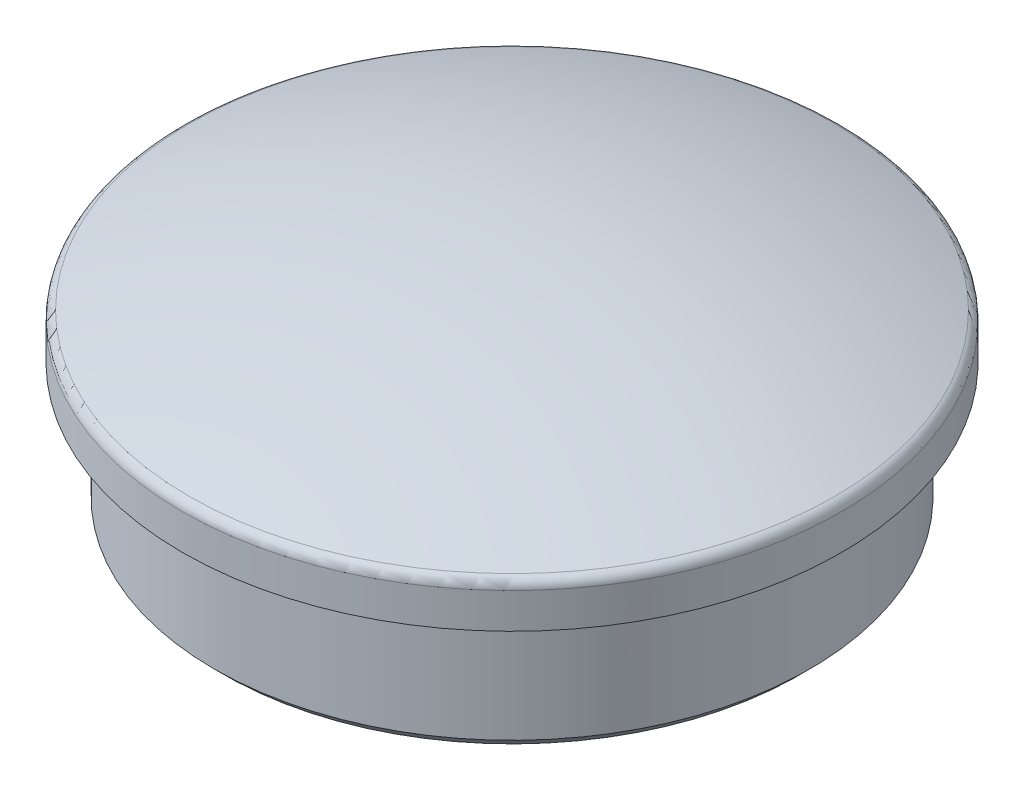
ISO-10303-21;
HEADER;
FILE_DESCRIPTION(('STEP AP214'),'2;1');
FILE_NAME('part.step','',(''),(''),'','','');
FILE_SCHEMA(('AUTOMOTIVE_DESIGN { 1 0 10303 214 1 1 1 1 }'));
ENDSEC;
DATA;
#1=APPLICATION_CONTEXT('core data for automotive mechanical design processes');
#2=APPLICATION_PROTOCOL_DEFINITION('international standard','automotive_design',2000,#1);
#3=PRODUCT_CONTEXT('',#1,'mechanical');
#4=PRODUCT('Part','Part','',(#3));
#5=PRODUCT_RELATED_PRODUCT_CATEGORY('part','',(#4));
#6=PRODUCT_DEFINITION_FORMATION('','',#4);
#7=PRODUCT_DEFINITION_CONTEXT('part definition',#1,'design');
#8=PRODUCT_DEFINITION('design','',#6,#7);
#9=PRODUCT_DEFINITION_SHAPE('','',#8);
#10=(LENGTH_UNIT() NAMED_UNIT(*) SI_UNIT(.MILLI.,.METRE.));
#11=(NAMED_UNIT(*) PLANE_ANGLE_UNIT() SI_UNIT($,.RADIAN.));
#12=(NAMED_UNIT(*) SI_UNIT($,.STERADIAN.) SOLID_ANGLE_UNIT());
#13=UNCERTAINTY_MEASURE_WITH_UNIT(LENGTH_MEASURE(1.E-05),#10,'distance_accuracy_value','');
#14=(GEOMETRIC_REPRESENTATION_CONTEXT(3) GLOBAL_UNCERTAINTY_ASSIGNED_CONTEXT((#13)) GLOBAL_UNIT_ASSIGNED_CONTEXT((#10,
#11,#12)) REPRESENTATION_CONTEXT('',''));
#15=CARTESIAN_POINT('',(0.,0.,0.));
#16=DIRECTION('',(0.,0.,1.));
#17=DIRECTION('',(1.,0.,0.));
#18=AXIS2_PLACEMENT_3D('',#15,#16,#17);
#19=CARTESIAN_POINT('',(0.,0.,0.));
#20=DIRECTION('',(0.,-1.,0.));
#21=DIRECTION('',(0.,0.,-1.));
#22=AXIS2_PLACEMENT_3D('',#19,#20,#21);
#23=PLANE('',#22);
#24=CARTESIAN_POINT('',(0.,0.,0.));
#25=DIRECTION('',(0.,-1.,0.));
#26=DIRECTION('',(0.,0.,-1.));
#27=AXIS2_PLACEMENT_3D('',#24,#25,#26);
#28=CIRCLE('',#27,13.5);
#29=CARTESIAN_POINT('',(0.,0.,-13.5));
#30=VERTEX_POINT('',#29);
#31=EDGE_CURVE('E148',#30,#30,#28,.T.);
#32=ORIENTED_EDGE('',*,*,#31,.T.);
#33=EDGE_LOOP('',(#32));
#34=FACE_BOUND('',#33,.T.);
#35=DIRECTION('',(0.5,0.,0.866025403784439));
#36=VECTOR('',#35,1.);
#37=CARTESIAN_POINT('',(5.19615242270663,0.,-9.00000000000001));
#38=LINE('',#37,#36);
#39=CARTESIAN_POINT('',(5.19615242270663,0.,-9.00000000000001));
#40=VERTEX_POINT('',#39);
#41=CARTESIAN_POINT('',(10.3923048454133,0.,0.));
#42=VERTEX_POINT('',#41);
#43=EDGE_CURVE('E47',#40,#42,#38,.T.);
#44=ORIENTED_EDGE('',*,*,#43,.F.);
#45=DIRECTION('',(1.,0.,0.));
#46=VECTOR('',#45,1.);
#47=CARTESIAN_POINT('',(-5.19615242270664,0.,-9.));
#48=LINE('',#47,#46);
#49=CARTESIAN_POINT('',(-5.19615242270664,0.,-9.));
#50=VERTEX_POINT('',#49);
#51=EDGE_CURVE('E130',#50,#40,#48,.T.);
#52=ORIENTED_EDGE('',*,*,#51,.F.);
#53=DIRECTION('',(0.5,0.,-0.866025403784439));
#54=VECTOR('',#53,1.);
#55=CARTESIAN_POINT('',(-10.3923048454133,0.,0.));
#56=LINE('',#55,#54);
#57=CARTESIAN_POINT('',(-10.3923048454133,0.,0.));
#58=VERTEX_POINT('',#57);
#59=EDGE_CURVE('E128',#58,#50,#56,.T.);
#60=ORIENTED_EDGE('',*,*,#59,.F.);
#61=DIRECTION('',(-0.5,0.,-0.866025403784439));
#62=VECTOR('',#61,1.);
#63=CARTESIAN_POINT('',(-5.19615242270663,0.,9.00000000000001));
#64=LINE('',#63,#62);
#65=CARTESIAN_POINT('',(-5.19615242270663,0.,9.00000000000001));
#66=VERTEX_POINT('',#65);
#67=EDGE_CURVE('E95',#66,#58,#64,.T.);
#68=ORIENTED_EDGE('',*,*,#67,.F.);
#69=DIRECTION('',(-1.,0.,0.));
#70=VECTOR('',#69,1.);
#71=CARTESIAN_POINT('',(5.19615242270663,0.,9.00000000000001));
#72=LINE('',#71,#70);
#73=CARTESIAN_POINT('',(5.19615242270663,0.,9.00000000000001));
#74=VERTEX_POINT('',#73);
#75=EDGE_CURVE('E124',#74,#66,#72,.T.);
#76=ORIENTED_EDGE('',*,*,#75,.F.);
#77=DIRECTION('',(-0.5,0.,0.866025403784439));
#78=VECTOR('',#77,1.);
#79=CARTESIAN_POINT('',(10.3923048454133,0.,0.));
#80=LINE('',#79,#78);
#81=EDGE_CURVE('E121',#42,#74,#80,.T.);
#82=ORIENTED_EDGE('',*,*,#81,.F.);
#83=EDGE_LOOP('',(#44,#52,#60,#68,#76,#82));
#84=FACE_BOUND('',#83,.T.);
#85=ADVANCED_FACE('F32',(#34,#84),#23,.T.);
#86=CARTESIAN_POINT('',(0.,20.6674121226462,0.));
#87=DIRECTION('',(0.,1.,0.));
#88=DIRECTION('',(0.,0.,1.));
#89=AXIS2_PLACEMENT_3D('',#86,#87,#88);
#90=CYLINDRICAL_SURFACE('',#89,14.);
#91=CARTESIAN_POINT('',(0.,0.5,0.));
#92=DIRECTION('',(0.,-1.,0.));
#93=DIRECTION('',(0.,0.,-1.));
#94=AXIS2_PLACEMENT_3D('',#91,#92,#93);
#95=CIRCLE('',#94,14.);
#96=CARTESIAN_POINT('',(0.,0.5,-14.));
#97=VERTEX_POINT('',#96);
#98=EDGE_CURVE('E145',#97,#97,#95,.F.);
#99=ORIENTED_EDGE('',*,*,#98,.T.);
#100=EDGE_LOOP('',(#99));
#101=FACE_BOUND('',#100,.T.);
#102=CARTESIAN_POINT('',(0.,6.,0.));
#103=DIRECTION('',(0.,1.,0.));
#104=DIRECTION('',(0.,0.,1.));
#105=AXIS2_PLACEMENT_3D('',#102,#103,#104);
#106=CIRCLE('',#105,14.);
#107=CARTESIAN_POINT('',(0.,6.,14.));
#108=VERTEX_POINT('',#107);
#109=EDGE_CURVE('E142',#108,#108,#106,.T.);
#110=ORIENTED_EDGE('',*,*,#109,.F.);
#111=EDGE_LOOP('',(#110));
#112=FACE_BOUND('',#111,.T.);
#113=ADVANCED_FACE('F164',(#101,#112),#90,.T.);
#114=CARTESIAN_POINT('',(-14.,6.,0.));
#115=DIRECTION('',(0.,-1.,0.));
#116=DIRECTION('',(0.,0.,-1.));
#117=AXIS2_PLACEMENT_3D('',#114,#115,#116);
#118=PLANE('',#117);
#119=ORIENTED_EDGE('',*,*,#109,.T.);
#120=EDGE_LOOP('',(#119));
#121=FACE_BOUND('',#120,.T.);
#122=CARTESIAN_POINT('',(0.,6.,0.));
#123=DIRECTION('',(0.,1.,0.));
#124=DIRECTION('',(0.,0.,1.));
#125=AXIS2_PLACEMENT_3D('',#122,#123,#124);
#126=CIRCLE('',#125,15.5);
#127=CARTESIAN_POINT('',(0.,6.,15.5));
#128=VERTEX_POINT('',#127);
#129=EDGE_CURVE('E134',#128,#128,#126,.T.);
#130=ORIENTED_EDGE('',*,*,#129,.F.);
#131=EDGE_LOOP('',(#130));
#132=FACE_BOUND('',#131,.T.);
#133=ADVANCED_FACE('F170',(#121,#132),#118,.T.);
#134=CARTESIAN_POINT('',(0.,20.6674121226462,0.));
#135=DIRECTION('',(0.,1.,0.));
#136=DIRECTION('',(0.,0.,1.));
#137=AXIS2_PLACEMENT_3D('',#134,#135,#136);
#138=CYLINDRICAL_SURFACE('',#137,15.5);
#139=CARTESIAN_POINT('',(0.,7.66066837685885,0.));
#140=DIRECTION('',(0.,-1.,0.));
#141=DIRECTION('',(0.,0.,-1.));
#142=AXIS2_PLACEMENT_3D('',#139,#140,#141);
#143=CIRCLE('',#142,15.5);
#144=CARTESIAN_POINT('',(0.,7.66066837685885,-15.5));
#145=VERTEX_POINT('',#144);
#146=EDGE_CURVE('E11',#145,#145,#143,.T.);
#147=ORIENTED_EDGE('',*,*,#146,.T.);
#148=EDGE_LOOP('',(#147));
#149=FACE_BOUND('',#148,.T.);
#150=ORIENTED_EDGE('',*,*,#129,.T.);
#151=EDGE_LOOP('',(#150));
#152=FACE_BOUND('',#151,.T.);
#153=ADVANCED_FACE('F177',(#149,#152),#138,.T.);
#154=CARTESIAN_POINT('',(0.,-30.5416666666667,0.));
#155=DIRECTION('',(0.,1.,0.));
#156=DIRECTION('',(-1.,0.,0.));
#157=AXIS2_PLACEMENT_3D('',#154,#155,#156);
#158=SPHERICAL_SURFACE('',#157,41.5416666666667);
#159=CARTESIAN_POINT('',(0.,8.12607753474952,0.));
#160=DIRECTION('',(0.,-1.,0.));
#161=DIRECTION('',(0.,0.,-1.));
#162=AXIS2_PLACEMENT_3D('',#159,#160,#161);
#163=CIRCLE('',#162,15.1827411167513);
#164=CARTESIAN_POINT('',(0.,8.12607753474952,-15.1827411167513));
#165=VERTEX_POINT('',#164);
#166=EDGE_CURVE('E40',#165,#165,#163,.F.);
#167=ORIENTED_EDGE('',*,*,#166,.T.);
#168=EDGE_LOOP('',(#167));
#169=FACE_BOUND('',#168,.T.);
#170=ADVANCED_FACE('F153',(#169),#158,.T.);
#171=CARTESIAN_POINT('',(5.19615242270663,9.,-9.00000000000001));
#172=DIRECTION('',(0.866025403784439,0.,-0.5));
#173=DIRECTION('',(-0.5,0.,-0.866025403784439));
#174=AXIS2_PLACEMENT_3D('',#171,#172,#173);
#175=PLANE('',#174);
#176=ORIENTED_EDGE('',*,*,#43,.T.);
#177=DIRECTION('',(0.,-1.,0.));
#178=VECTOR('',#177,1.);
#179=CARTESIAN_POINT('',(10.3923048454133,9.,0.));
#180=LINE('',#179,#178);
#181=CARTESIAN_POINT('',(10.3923048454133,9.,0.));
#182=VERTEX_POINT('',#181);
#183=EDGE_CURVE('E77',#182,#42,#180,.T.);
#184=ORIENTED_EDGE('',*,*,#183,.F.);
#185=DIRECTION('',(0.5,0.,0.866025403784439));
#186=VECTOR('',#185,1.);
#187=CARTESIAN_POINT('',(5.19615242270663,9.,-9.00000000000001));
#188=LINE('',#187,#186);
#189=CARTESIAN_POINT('',(5.19615242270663,9.,-9.00000000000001));
#190=VERTEX_POINT('',#189);
#191=EDGE_CURVE('E132',#190,#182,#188,.T.);
#192=ORIENTED_EDGE('',*,*,#191,.F.);
#193=DIRECTION('',(0.,-1.,0.));
#194=VECTOR('',#193,1.);
#195=CARTESIAN_POINT('',(5.19615242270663,9.,-9.00000000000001));
#196=LINE('',#195,#194);
#197=EDGE_CURVE('E55',#190,#40,#196,.T.);
#198=ORIENTED_EDGE('',*,*,#197,.T.);
#199=EDGE_LOOP('',(#176,#184,#192,#198));
#200=FACE_BOUND('',#199,.T.);
#201=ADVANCED_FACE('F184',(#200),#175,.F.);
#202=CARTESIAN_POINT('',(-5.19615242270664,9.,-9.));
#203=DIRECTION('',(0.,0.,-1.));
#204=DIRECTION('',(-1.,0.,0.));
#205=AXIS2_PLACEMENT_3D('',#202,#203,#204);
#206=PLANE('',#205);
#207=ORIENTED_EDGE('',*,*,#51,.T.);
#208=ORIENTED_EDGE('',*,*,#197,.F.);
#209=DIRECTION('',(1.,0.,0.));
#210=VECTOR('',#209,1.);
#211=CARTESIAN_POINT('',(-5.19615242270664,9.,-9.));
#212=LINE('',#211,#210);
#213=CARTESIAN_POINT('',(-5.19615242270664,9.,-9.));
#214=VERTEX_POINT('',#213);
#215=EDGE_CURVE('E107',#214,#190,#212,.T.);
#216=ORIENTED_EDGE('',*,*,#215,.F.);
#217=DIRECTION('',(0.,-1.,0.));
#218=VECTOR('',#217,1.);
#219=CARTESIAN_POINT('',(-5.19615242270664,9.,-9.));
#220=LINE('',#219,#218);
#221=EDGE_CURVE('E99',#214,#50,#220,.T.);
#222=ORIENTED_EDGE('',*,*,#221,.T.);
#223=EDGE_LOOP('',(#207,#208,#216,#222));
#224=FACE_BOUND('',#223,.T.);
#225=ADVANCED_FACE('F187',(#224),#206,.F.);
#226=CARTESIAN_POINT('',(-10.3923048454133,9.,0.));
#227=DIRECTION('',(-0.866025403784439,0.,-0.5));
#228=DIRECTION('',(-0.5,0.,0.866025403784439));
#229=AXIS2_PLACEMENT_3D('',#226,#227,#228);
#230=PLANE('',#229);
#231=ORIENTED_EDGE('',*,*,#59,.T.);
#232=ORIENTED_EDGE('',*,*,#221,.F.);
#233=DIRECTION('',(0.5,0.,-0.866025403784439));
#234=VECTOR('',#233,1.);
#235=CARTESIAN_POINT('',(-10.3923048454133,9.,0.));
#236=LINE('',#235,#234);
#237=CARTESIAN_POINT('',(-10.3923048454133,9.,0.));
#238=VERTEX_POINT('',#237);
#239=EDGE_CURVE('E103',#238,#214,#236,.T.);
#240=ORIENTED_EDGE('',*,*,#239,.F.);
#241=DIRECTION('',(0.,-1.,0.));
#242=VECTOR('',#241,1.);
#243=CARTESIAN_POINT('',(-10.3923048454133,9.,0.));
#244=LINE('',#243,#242);
#245=EDGE_CURVE('E88',#238,#58,#244,.T.);
#246=ORIENTED_EDGE('',*,*,#245,.T.);
#247=EDGE_LOOP('',(#231,#232,#240,#246));
#248=FACE_BOUND('',#247,.T.);
#249=ADVANCED_FACE('F104',(#248),#230,.F.);
#250=CARTESIAN_POINT('',(-5.19615242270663,9.,9.00000000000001));
#251=DIRECTION('',(-0.866025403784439,0.,0.5));
#252=DIRECTION('',(0.5,0.,0.866025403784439));
#253=AXIS2_PLACEMENT_3D('',#250,#251,#252);
#254=PLANE('',#253);
#255=ORIENTED_EDGE('',*,*,#67,.T.);
#256=ORIENTED_EDGE('',*,*,#245,.F.);
#257=DIRECTION('',(-0.5,0.,-0.866025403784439));
#258=VECTOR('',#257,1.);
#259=CARTESIAN_POINT('',(-5.19615242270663,9.,9.00000000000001));
#260=LINE('',#259,#258);
#261=CARTESIAN_POINT('',(-5.19615242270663,9.,9.00000000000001));
#262=VERTEX_POINT('',#261);
#263=EDGE_CURVE('E92',#262,#238,#260,.T.);
#264=ORIENTED_EDGE('',*,*,#263,.F.);
#265=DIRECTION('',(0.,-1.,0.));
#266=VECTOR('',#265,1.);
#267=CARTESIAN_POINT('',(-5.19615242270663,9.,9.00000000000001));
#268=LINE('',#267,#266);
#269=EDGE_CURVE('E100',#262,#66,#268,.T.);
#270=ORIENTED_EDGE('',*,*,#269,.T.);
#271=EDGE_LOOP('',(#255,#256,#264,#270));
#272=FACE_BOUND('',#271,.T.);
#273=ADVANCED_FACE('F90',(#272),#254,.F.);
#274=CARTESIAN_POINT('',(5.19615242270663,9.,9.00000000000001));
#275=DIRECTION('',(0.,0.,1.));
#276=DIRECTION('',(1.,0.,0.));
#277=AXIS2_PLACEMENT_3D('',#274,#275,#276);
#278=PLANE('',#277);
#279=ORIENTED_EDGE('',*,*,#75,.T.);
#280=ORIENTED_EDGE('',*,*,#269,.F.);
#281=DIRECTION('',(-1.,0.,0.));
#282=VECTOR('',#281,1.);
#283=CARTESIAN_POINT('',(5.19615242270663,9.,9.00000000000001));
#284=LINE('',#283,#282);
#285=CARTESIAN_POINT('',(5.19615242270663,9.,9.00000000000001));
#286=VERTEX_POINT('',#285);
#287=EDGE_CURVE('E113',#286,#262,#284,.T.);
#288=ORIENTED_EDGE('',*,*,#287,.F.);
#289=DIRECTION('',(0.,-1.,0.));
#290=VECTOR('',#289,1.);
#291=CARTESIAN_POINT('',(5.19615242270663,9.,9.00000000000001));
#292=LINE('',#291,#290);
#293=EDGE_CURVE('E137',#286,#74,#292,.T.);
#294=ORIENTED_EDGE('',*,*,#293,.T.);
#295=EDGE_LOOP('',(#279,#280,#288,#294));
#296=FACE_BOUND('',#295,.T.);
#297=ADVANCED_FACE('F191',(#296),#278,.F.);
#298=CARTESIAN_POINT('',(10.3923048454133,9.,0.));
#299=DIRECTION('',(0.866025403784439,0.,0.5));
#300=DIRECTION('',(0.5,0.,-0.866025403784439));
#301=AXIS2_PLACEMENT_3D('',#298,#299,#300);
#302=PLANE('',#301);
#303=ORIENTED_EDGE('',*,*,#81,.T.);
#304=ORIENTED_EDGE('',*,*,#293,.F.);
#305=DIRECTION('',(-0.5,0.,0.866025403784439));
#306=VECTOR('',#305,1.);
#307=CARTESIAN_POINT('',(10.3923048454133,9.,0.));
#308=LINE('',#307,#306);
#309=EDGE_CURVE('E115',#182,#286,#308,.T.);
#310=ORIENTED_EDGE('',*,*,#309,.F.);
#311=ORIENTED_EDGE('',*,*,#183,.T.);
#312=EDGE_LOOP('',(#303,#304,#310,#311));
#313=FACE_BOUND('',#312,.T.);
#314=ADVANCED_FACE('F188',(#313),#302,.F.);
#315=CARTESIAN_POINT('',(0.,9.,0.));
#316=DIRECTION('',(0.,-1.,0.));
#317=DIRECTION('',(0.,0.,-1.));
#318=AXIS2_PLACEMENT_3D('',#315,#316,#317);
#319=PLANE('',#318);
#320=ORIENTED_EDGE('',*,*,#191,.T.);
#321=ORIENTED_EDGE('',*,*,#309,.T.);
#322=ORIENTED_EDGE('',*,*,#287,.T.);
#323=ORIENTED_EDGE('',*,*,#263,.T.);
#324=ORIENTED_EDGE('',*,*,#239,.T.);
#325=ORIENTED_EDGE('',*,*,#215,.T.);
#326=EDGE_LOOP('',(#320,#321,#322,#323,#324,#325));
#327=FACE_BOUND('',#326,.T.);
#328=ADVANCED_FACE('F110',(#327),#319,.T.);
#329=CARTESIAN_POINT('',(0.,0.5,0.));
#330=DIRECTION('',(0.,1.,0.));
#331=DIRECTION('',(0.,0.,1.));
#332=AXIS2_PLACEMENT_3D('',#329,#330,#331);
#333=CONICAL_SURFACE('',#332,14.,0.785398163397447);
#334=ORIENTED_EDGE('',*,*,#31,.F.);
#335=EDGE_LOOP('',(#334));
#336=FACE_BOUND('',#335,.T.);
#337=ORIENTED_EDGE('',*,*,#98,.F.);
#338=EDGE_LOOP('',(#337));
#339=FACE_BOUND('',#338,.T.);
#340=ADVANCED_FACE('F156',(#336,#339),#333,.T.);
#341=CARTESIAN_POINT('',(0.,7.66066837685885,0.));
#342=DIRECTION('',(0.,-1.,0.));
#343=DIRECTION('',(0.,0.,-1.));
#344=AXIS2_PLACEMENT_3D('',#341,#342,#343);
#345=TOROIDAL_SURFACE('',#344,15.,0.5);
#346=ORIENTED_EDGE('',*,*,#146,.F.);
#347=EDGE_LOOP('',(#346));
#348=FACE_BOUND('',#347,.T.);
#349=ORIENTED_EDGE('',*,*,#166,.F.);
#350=EDGE_LOOP('',(#349));
#351=FACE_BOUND('',#350,.T.);
#352=ADVANCED_FACE('F34',(#348,#351),#345,.T.);
#353=CLOSED_SHELL('',(#85,#113,#133,#153,#170,#201,#225,#249,#273,#297,#314,#328,#340,#352));
#354=MANIFOLD_SOLID_BREP('B2',#353);
#355=ADVANCED_BREP_SHAPE_REPRESENTATION('',(#18,#354),#14);
#356=SHAPE_DEFINITION_REPRESENTATION(#9,#355);
ENDSEC;
END-ISO-10303-21;
